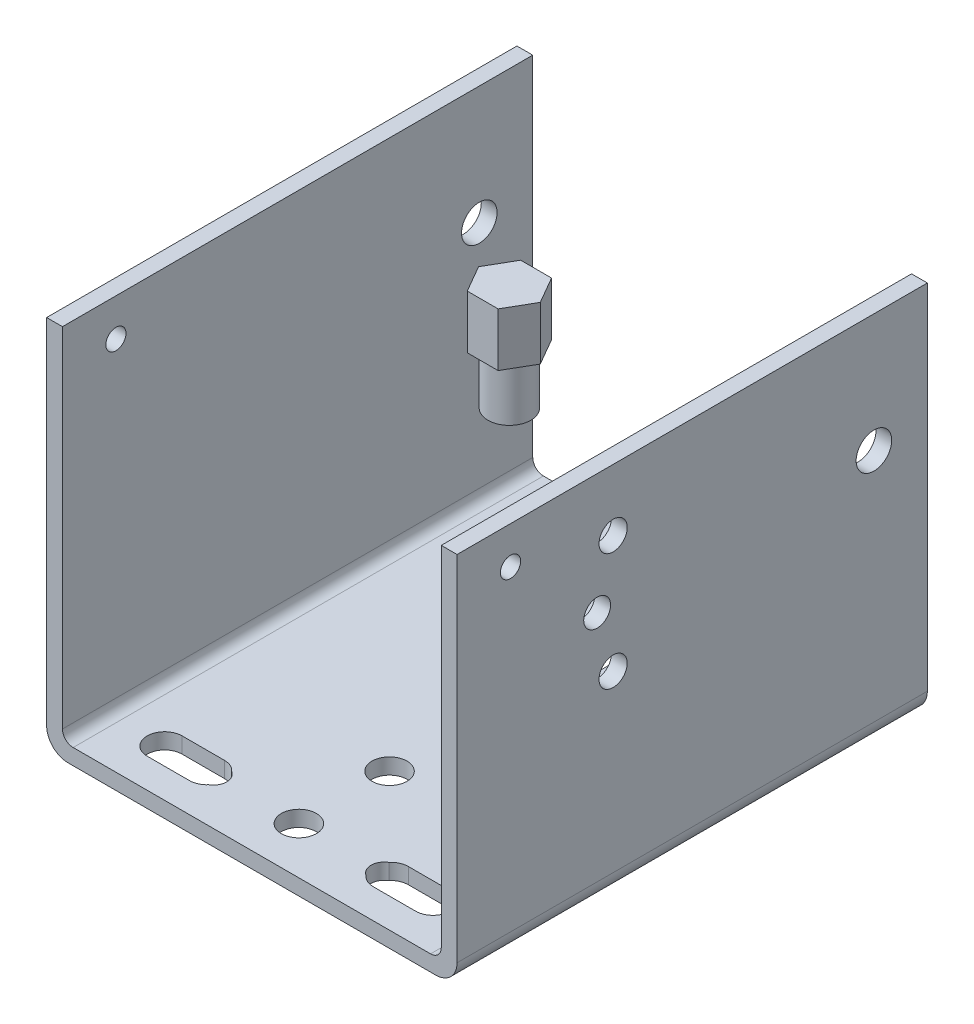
from build123d import *

# Parameters (mm, degrees)
BOSS_EXTRUDE1_DEPTH = 139.7
FILLET1_R           = 3.175
FILLET2_R           = 6.35
SKETCH4_R           = 5.2832
SKETCH4_R_2         = 2.9972
CUT_EXTRUDE1_DEPTH  = 76.2
SKETCH5_R           = 4.191
SKETCH5_R_2         = 3.9878
CUT_EXTRUDE2_DEPTH  = 101.6
SKETCH7_R           = 5.207
CUT_EXTRUDE3_DEPTH  = 25.4
SKETCH8_R           = 3.9624
CUT_EXTRUDE4_DEPTH  = 25.4
BOSS_EXTRUDE2_START = 127
BOSS_EXTRUDE2_DEPTH = 15.875
BOSS_EXTRUDE3_START = 127
SKETCH10_R          = 6.35
BOSS_EXTRUDE3_DEPTH = 15.875


with BuildPart() as part:
    # Sketch1 → Boss-Extrude1 (new body)
    with BuildSketch(Plane.XY):
        Polygon((0, 0), (60.96, 0), (60.96, 111.379), (56.261, 111.379), (56.261, 4.699), (-56.261, 4.699), (-56.261, 111.379), (-60.96, 111.379), (-60.96, 0), align=None)
    extrude(amount=BOSS_EXTRUDE1_DEPTH)

    # Fillet1
    fillet1_edges = [part.edges().sort_by_distance(p)[0] for p in [
        (-56.261, 4.699, 69.85),
        (56.261, 4.699, 69.85),
    ]]
    fillet(fillet1_edges, radius=FILLET1_R)

    # Fillet2
    fillet2_edges = [part.edges().sort_by_distance(p)[0] for p in [
        (-60.96, 0, 69.85),
        (60.96, 0, 69.85),
    ]]
    fillet(fillet2_edges, radius=FILLET2_R)

    # Sketch4 → Cut-Extrude1 (cut, symmetric)
    with BuildSketch(Plane(origin=(0, 0, 0), x_dir=(0, 0, -1), z_dir=(1, 0, 0))):
        with Locations((-15.875, 76.2)):
            Circle(SKETCH4_R)
        with Locations((-123.825, 100.2538)):
            Circle(SKETCH4_R_2)
    extrude(amount=CUT_EXTRUDE1_DEPTH, both=True, mode=Mode.SUBTRACT)

    # Sketch5 → Cut-Extrude2 (cut)
    with BuildSketch(Plane(origin=(0, 0, 0), x_dir=(0, 0, -1), z_dir=(1, 0, 0))):
        with Locations(Location((-93.345, 58.166, 0), (0, 0, 180))):
            Circle(SKETCH5_R)
        with Locations(Location((-93.345, 93.0656, 0), (0, 0, 180))):
            Circle(SKETCH5_R)
        with Locations(Location((-98.0948, 75.6158, 0), (0, 0, 180))):
            Circle(SKETCH5_R_2)
    extrude(amount=CUT_EXTRUDE2_DEPTH, mode=Mode.SUBTRACT)

    # Sketch7 → Cut-Extrude3 (cut)
    with BuildSketch(Plane(origin=(0, 0, 0), x_dir=(1, 0, 0), z_dir=(0, 1, 0))):
        with Locations(Location((0, -125.73, 0), (0, 0, 90))):
            Circle(SKETCH7_R)
        with Locations(Location((0, -98.806, 0), (0, 0, 90))):
            Circle(SKETCH7_R)
        with BuildLine():
            Line((-39.878, -130.937), (-27.305, -130.937))
            ThreePointArc((-27.305, -130.937), (-22.098, -125.73), (-27.305, -120.523))
            Line((-27.305, -120.523), (-39.878, -120.523))
            ThreePointArc((-39.878, -120.523), (-45.085, -125.73), (-39.878, -130.937))
        make_face()
        with BuildLine():
            Line((27.305, -130.937), (39.878, -130.937))
            ThreePointArc((39.878, -130.937), (45.085, -125.73), (39.878, -120.523))
            Line((39.878, -120.523), (27.305, -120.523))
            ThreePointArc((27.305, -120.523), (22.098, -125.73), (27.305, -130.937))
        make_face()
        with BuildLine():
            Line((5.334, -15.875), (5.334, -46.355))
            ThreePointArc((5.334, -46.355), (0, -51.689), (-5.334, -46.355))
            Line((-5.334, -46.355), (-5.334, -15.875))
            ThreePointArc((-5.334, -15.875), (0, -10.541), (5.334, -15.875))
        make_face()
    extrude(amount=CUT_EXTRUDE3_DEPTH, mode=Mode.SUBTRACT)

    # Sketch8 → Cut-Extrude4 (cut)
    with BuildSketch(Plane(origin=(0, 0, 0), x_dir=(1, 0, 0), z_dir=(0, 1, 0))):
        with Locations((-25.4, -125.73)):
            Circle(SKETCH8_R)
        with Locations((25.4, -125.73)):
            Circle(SKETCH8_R)
        with Locations(Location((-25.4, -14.605, 0), (0, 0, 90))):
            Circle(SKETCH8_R)
    extrude(amount=CUT_EXTRUDE4_DEPTH, mode=Mode.SUBTRACT)


with BuildPart() as body_2:
    # Sketch9 → Boss-Extrude2 (new body)
    with BuildSketch(Plane(origin=(0, 0, 0), x_dir=(1, 0, 0), z_dir=(0, 1, 0)).offset(BOSS_EXTRUDE2_START)):
        Polygon((26.202082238, -101.9175), (35.367517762, -101.9175), (39.950235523, -93.98), (35.367517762, -86.0425), (26.202082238, -86.0425), (21.619364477, -93.98), align=None)
    extrude(amount=BOSS_EXTRUDE2_DEPTH)

    # Sketch10 → Boss-Extrude3 (add)
    with BuildSketch(Plane(origin=(0, 0, 0), x_dir=(1, 0, 0), z_dir=(0, 1, 0)).offset(BOSS_EXTRUDE3_START)):
        with Locations(Location((30.7848, -93.98, 0), (0, 0, 270))):
            Circle(SKETCH10_R)
    extrude(amount=-BOSS_EXTRUDE3_DEPTH)


solid = Compound([part.part, body_2.part])
